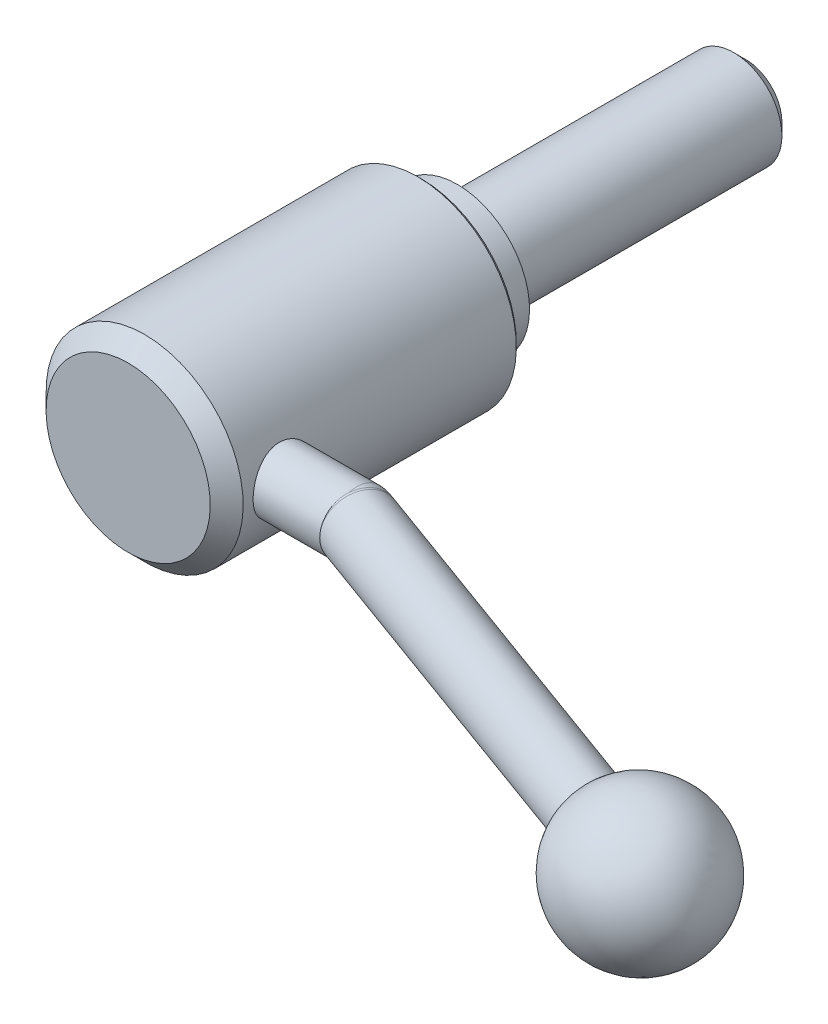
ISO-10303-21;
HEADER;
FILE_DESCRIPTION(('STEP AP214'),'2;1');
FILE_NAME('part.step','',(''),(''),'','','');
FILE_SCHEMA(('AUTOMOTIVE_DESIGN { 1 0 10303 214 1 1 1 1 }'));
ENDSEC;
DATA;
#1=APPLICATION_CONTEXT('core data for automotive mechanical design processes');
#2=APPLICATION_PROTOCOL_DEFINITION('international standard','automotive_design',2000,#1);
#3=PRODUCT_CONTEXT('',#1,'mechanical');
#4=PRODUCT('Part','Part','',(#3));
#5=PRODUCT_RELATED_PRODUCT_CATEGORY('part','',(#4));
#6=PRODUCT_DEFINITION_FORMATION('','',#4);
#7=PRODUCT_DEFINITION_CONTEXT('part definition',#1,'design');
#8=PRODUCT_DEFINITION('design','',#6,#7);
#9=PRODUCT_DEFINITION_SHAPE('','',#8);
#10=(LENGTH_UNIT() NAMED_UNIT(*) SI_UNIT(.MILLI.,.METRE.));
#11=(NAMED_UNIT(*) PLANE_ANGLE_UNIT() SI_UNIT($,.RADIAN.));
#12=(NAMED_UNIT(*) SI_UNIT($,.STERADIAN.) SOLID_ANGLE_UNIT());
#13=UNCERTAINTY_MEASURE_WITH_UNIT(LENGTH_MEASURE(1.E-05),#10,'distance_accuracy_value','');
#14=(GEOMETRIC_REPRESENTATION_CONTEXT(3) GLOBAL_UNCERTAINTY_ASSIGNED_CONTEXT((#13)) GLOBAL_UNIT_ASSIGNED_CONTEXT((#10,
#11,#12)) REPRESENTATION_CONTEXT('',''));
#15=CARTESIAN_POINT('',(0.,0.,0.));
#16=DIRECTION('',(0.,0.,1.));
#17=DIRECTION('',(1.,0.,0.));
#18=AXIS2_PLACEMENT_3D('',#15,#16,#17);
#19=CARTESIAN_POINT('',(0.,0.,0.));
#20=DIRECTION('',(0.,0.,-1.));
#21=DIRECTION('',(0.,1.,0.));
#22=AXIS2_PLACEMENT_3D('',#19,#20,#21);
#23=CYLINDRICAL_SURFACE('',#22,20.5);
#24=CARTESIAN_POINT('',(0.,0.,8.25));
#25=DIRECTION('',(0.,0.,-1.));
#26=DIRECTION('',(0.,1.,0.));
#27=AXIS2_PLACEMENT_3D('',#24,#25,#26);
#28=CIRCLE('',#27,20.5);
#29=CARTESIAN_POINT('',(0.,20.5,8.25));
#30=VERTEX_POINT('',#29);
#31=EDGE_CURVE('E160',#30,#30,#28,.T.);
#32=ORIENTED_EDGE('',*,*,#31,.F.);
#33=EDGE_LOOP('',(#32));
#34=FACE_BOUND('',#33,.T.);
#35=CARTESIAN_POINT('',(19.4422220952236,6.5,56.5));
#36=CARTESIAN_POINT('',(19.4422222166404,6.49999984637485,56.6775608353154));
#37=CARTESIAN_POINT('',(19.4446611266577,6.49271825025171,56.8551242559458));
#38=CARTESIAN_POINT('',(19.454338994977,6.46366201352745,57.2089295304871));
#39=CARTESIAN_POINT('',(19.4615780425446,6.44188710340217,57.3851713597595));
#40=CARTESIAN_POINT('',(19.4806268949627,6.38405046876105,57.7350468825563));
#41=CARTESIAN_POINT('',(19.4924368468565,6.34798828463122,57.9086804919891));
#42=CARTESIAN_POINT('',(19.5202654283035,6.26189122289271,58.2521641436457));
#43=CARTESIAN_POINT('',(19.5362855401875,6.2118514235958,58.4220128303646));
#44=CARTESIAN_POINT('',(19.5720112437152,6.09835258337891,58.7563693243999));
#45=CARTESIAN_POINT('',(19.5917092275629,6.03492120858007,58.9208873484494));
#46=CARTESIAN_POINT('',(19.6342385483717,5.89508386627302,59.2438952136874));
#47=CARTESIAN_POINT('',(19.6570700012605,5.8186774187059,59.4023848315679));
#48=CARTESIAN_POINT('',(19.7052295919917,5.65343532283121,59.7124029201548));
#49=CARTESIAN_POINT('',(19.7305584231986,5.5645962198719,59.8639294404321));
#50=CARTESIAN_POINT('',(19.7830095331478,5.37514542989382,60.159036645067));
#51=CARTESIAN_POINT('',(19.810131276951,5.27453724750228,60.3026196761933));
#52=CARTESIAN_POINT('',(19.8663573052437,5.05872294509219,60.5855845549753));
#53=CARTESIAN_POINT('',(19.8954973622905,4.94314912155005,60.7246789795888));
#54=CARTESIAN_POINT('',(19.9541229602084,4.70090397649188,60.9926738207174));
#55=CARTESIAN_POINT('',(19.9836083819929,4.57423638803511,61.1215776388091));
#56=CARTESIAN_POINT('',(20.0421539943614,4.31048905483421,61.3685042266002));
#57=CARTESIAN_POINT('',(20.071213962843,4.1734040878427,61.4865214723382));
#58=CARTESIAN_POINT('',(20.1281044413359,3.88977145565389,61.7107919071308));
#59=CARTESIAN_POINT('',(20.1559354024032,3.74322731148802,61.8170494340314));
#60=CARTESIAN_POINT('',(20.2102746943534,3.43793523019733,62.0195055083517));
#61=CARTESIAN_POINT('',(20.236735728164,3.2789797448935,62.1154041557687));
#62=CARTESIAN_POINT('',(20.2868421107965,2.95316588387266,62.2933802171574));
#63=CARTESIAN_POINT('',(20.3104885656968,2.786310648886,62.3754630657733));
#64=CARTESIAN_POINT('',(20.3543059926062,2.44575238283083,62.5251888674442));
#65=CARTESIAN_POINT('',(20.3744761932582,2.27204784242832,62.5928286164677));
#66=CARTESIAN_POINT('',(20.4107390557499,1.9191592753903,62.7130148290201));
#67=CARTESIAN_POINT('',(20.4268335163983,1.73997770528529,62.7655679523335));
#68=CARTESIAN_POINT('',(20.4540467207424,1.38310784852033,62.8537177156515));
#69=CARTESIAN_POINT('',(20.4653055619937,1.20554867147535,62.8897940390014));
#70=CARTESIAN_POINT('',(20.483240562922,0.847880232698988,62.9470057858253));
#71=CARTESIAN_POINT('',(20.489918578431,0.667772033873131,62.9681472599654));
#72=CARTESIAN_POINT('',(20.4985086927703,0.306306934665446,62.9953079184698));
#73=CARTESIAN_POINT('',(20.5004208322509,0.124950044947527,63.0013272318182));
#74=CARTESIAN_POINT('',(20.4994243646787,-0.237616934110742,62.9981845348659));
#75=CARTESIAN_POINT('',(20.4965158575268,-0.418827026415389,62.9890228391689));
#76=CARTESIAN_POINT('',(20.4861511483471,-0.773249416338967,62.9562077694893));
#77=CARTESIAN_POINT('',(20.4788613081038,-0.946515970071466,62.9330843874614));
#78=CARTESIAN_POINT('',(20.4600679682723,-1.29046183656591,62.8730051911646));
#79=CARTESIAN_POINT('',(20.4485630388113,-1.46114025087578,62.8360446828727));
#80=CARTESIAN_POINT('',(20.4216452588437,-1.798625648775,62.7486256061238));
#81=CARTESIAN_POINT('',(20.4062336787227,-1.9654338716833,62.6981714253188));
#82=CARTESIAN_POINT('',(20.3718916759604,-2.29420139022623,62.5841535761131));
#83=CARTESIAN_POINT('',(20.35295992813,-2.45615883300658,62.5205849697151));
#84=CARTESIAN_POINT('',(20.3118147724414,-2.77605889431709,62.3799991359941));
#85=CARTESIAN_POINT('',(20.2895645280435,-2.93392950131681,62.3028289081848));
#86=CARTESIAN_POINT('',(20.2425168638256,-3.24266972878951,62.1361230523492));
#87=CARTESIAN_POINT('',(20.2177185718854,-3.39353692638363,62.0465831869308));
#88=CARTESIAN_POINT('',(20.1662066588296,-3.68732340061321,61.8557751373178));
#89=CARTESIAN_POINT('',(20.1394929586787,-3.8302423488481,61.7545064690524));
#90=CARTESIAN_POINT('',(20.0848204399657,-4.10730208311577,61.5408997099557));
#91=CARTESIAN_POINT('',(20.0568615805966,-4.24144258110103,61.4285612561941));
#92=CARTESIAN_POINT('',(19.9991827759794,-4.50574800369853,61.1884400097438));
#93=CARTESIAN_POINT('',(19.9694388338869,-4.63549313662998,61.0602005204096));
#94=CARTESIAN_POINT('',(19.9101839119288,-4.88373422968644,60.7932909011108));
#95=CARTESIAN_POINT('',(19.8806728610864,-5.00223374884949,60.6546240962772));
#96=CARTESIAN_POINT('',(19.8226810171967,-5.22731613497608,60.3676143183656));
#97=CARTESIAN_POINT('',(19.7942007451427,-5.33389303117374,60.2192665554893));
#98=CARTESIAN_POINT('',(19.739110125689,-5.53428674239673,59.9139422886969));
#99=CARTESIAN_POINT('',(19.7124990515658,-5.62810852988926,59.7569691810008));
#100=CARTESIAN_POINT('',(19.6616069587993,-5.80341705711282,59.4333642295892));
#101=CARTESIAN_POINT('',(19.6373585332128,-5.88473833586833,59.2666375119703));
#102=CARTESIAN_POINT('',(19.5923338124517,-6.03294761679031,58.9265081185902));
#103=CARTESIAN_POINT('',(19.5715561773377,-6.09984119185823,58.7531080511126));
#104=CARTESIAN_POINT('',(19.5341361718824,-6.21863379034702,58.4008267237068));
#105=CARTESIAN_POINT('',(19.5174933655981,-6.2705343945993,58.2219460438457));
#106=CARTESIAN_POINT('',(19.4888985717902,-6.35885149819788,57.8600357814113));
#107=CARTESIAN_POINT('',(19.4769463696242,-6.39526870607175,57.6770063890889));
#108=CARTESIAN_POINT('',(19.4585313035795,-6.45107630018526,57.3158506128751));
#109=CARTESIAN_POINT('',(19.4518622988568,-6.47110721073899,57.1378335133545));
#110=CARTESIAN_POINT('',(19.443427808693,-6.49640633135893,56.7806394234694));
#111=CARTESIAN_POINT('',(19.4416621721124,-6.50167499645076,56.6014624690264));
#112=CARTESIAN_POINT('',(19.443091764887,-6.49739848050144,56.2433320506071));
#113=CARTESIAN_POINT('',(19.4462862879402,-6.48785540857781,56.0643785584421));
#114=CARTESIAN_POINT('',(19.4575309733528,-6.45405335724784,55.7080231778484));
#115=CARTESIAN_POINT('',(19.4655810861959,-6.4297945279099,55.5306212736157));
#116=CARTESIAN_POINT('',(19.4859636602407,-6.36775067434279,55.1840196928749));
#117=CARTESIAN_POINT('',(19.4981590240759,-6.33039761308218,55.0147343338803));
#118=CARTESIAN_POINT('',(19.5265148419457,-6.24238368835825,54.6799411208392));
#119=CARTESIAN_POINT('',(19.5426766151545,-6.19171839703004,54.5144345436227));
#120=CARTESIAN_POINT('',(19.5784935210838,-6.07751333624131,54.1883625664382));
#121=CARTESIAN_POINT('',(19.598147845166,-6.01397654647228,54.0277960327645));
#122=CARTESIAN_POINT('',(19.6404122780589,-5.87448001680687,53.7124890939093));
#123=CARTESIAN_POINT('',(19.663023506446,-5.79851556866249,53.5577509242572));
#124=CARTESIAN_POINT('',(19.711276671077,-5.63234141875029,53.2506795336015));
#125=CARTESIAN_POINT('',(19.7369874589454,-5.54178262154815,53.0985460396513));
#126=CARTESIAN_POINT('',(19.7901869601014,-5.34869406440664,52.8023330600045));
#127=CARTESIAN_POINT('',(19.8176762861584,-5.24616016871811,52.6582563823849));
#128=CARTESIAN_POINT('',(19.8736901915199,-5.02980339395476,52.3790447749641));
#129=CARTESIAN_POINT('',(19.9022148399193,-4.91597976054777,52.2439104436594));
#130=CARTESIAN_POINT('',(19.9595511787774,-4.67774787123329,51.9833824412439));
#131=CARTESIAN_POINT('',(19.9883628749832,-4.55333940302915,51.8579889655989));
#132=CARTESIAN_POINT('',(20.0467640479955,-4.28909489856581,51.612508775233));
#133=CARTESIAN_POINT('',(20.0763335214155,-4.14882502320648,51.4928837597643));
#134=CARTESIAN_POINT('',(20.1341446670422,-3.85851185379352,51.2658977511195));
#135=CARTESIAN_POINT('',(20.1623867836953,-3.70847187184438,51.1585326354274));
#136=CARTESIAN_POINT('',(20.2167791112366,-3.39947872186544,50.956751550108));
#137=CARTESIAN_POINT('',(20.2429285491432,-3.24052229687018,50.8623403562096));
#138=CARTESIAN_POINT('',(20.2923799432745,-2.91486277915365,50.6872782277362));
#139=CARTESIAN_POINT('',(20.31568308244,-2.74816294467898,50.606621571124));
#140=CARTESIAN_POINT('',(20.3586447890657,-2.40926409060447,50.4601915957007));
#141=CARTESIAN_POINT('',(20.3783271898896,-2.23711047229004,50.3943202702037));
#142=CARTESIAN_POINT('',(20.4136744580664,-1.88752303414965,50.2773627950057));
#143=CARTESIAN_POINT('',(20.4293409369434,-1.71009136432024,50.2262707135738));
#144=CARTESIAN_POINT('',(20.4562117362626,-1.35121271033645,50.1393152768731));
#145=CARTESIAN_POINT('',(20.4674163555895,-1.16976599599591,50.1034509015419));
#146=CARTESIAN_POINT('',(20.4850348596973,-0.804250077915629,50.0472977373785));
#147=CARTESIAN_POINT('',(20.4914489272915,-0.620180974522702,50.0270083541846));
#148=CARTESIAN_POINT('',(20.4991281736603,-0.258824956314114,50.0027406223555));
#149=CARTESIAN_POINT('',(20.5006028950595,-0.0815867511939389,49.9980984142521));
#150=CARTESIAN_POINT('',(20.4989516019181,0.272717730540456,50.0033067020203));
#151=CARTESIAN_POINT('',(20.4958240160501,0.449783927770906,50.0131621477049));
#152=CARTESIAN_POINT('',(20.4850529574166,0.802303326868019,50.0472753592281));
#153=CARTESIAN_POINT('',(20.477411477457,0.977757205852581,50.0715267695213));
#154=CARTESIAN_POINT('',(20.4578179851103,1.32593306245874,50.1342162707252));
#155=CARTESIAN_POINT('',(20.4458643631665,1.49865399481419,50.1726596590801));
#156=CARTESIAN_POINT('',(20.4181583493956,1.83775920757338,50.2627729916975));
#157=CARTESIAN_POINT('',(20.4024599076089,2.00419775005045,50.314255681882));
#158=CARTESIAN_POINT('',(20.3675799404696,2.33214296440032,50.430290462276));
#159=CARTESIAN_POINT('',(20.3483971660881,2.49364784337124,50.4948472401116));
#160=CARTESIAN_POINT('',(20.3070431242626,2.8106122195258,50.6365039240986));
#161=CARTESIAN_POINT('',(20.2848725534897,2.96607311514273,50.7136009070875));
#162=CARTESIAN_POINT('',(20.2380837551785,3.2701125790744,50.8798225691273));
#163=CARTESIAN_POINT('',(20.2134646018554,3.41868851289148,50.9689518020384));
#164=CARTESIAN_POINT('',(20.1615167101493,3.71299497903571,51.1618658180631));
#165=CARTESIAN_POINT('',(20.1341240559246,3.85845386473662,51.2660479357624));
#166=CARTESIAN_POINT('',(20.0780825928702,4.14019829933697,51.4859491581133));
#167=CARTESIAN_POINT('',(20.0494333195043,4.27648040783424,51.6016725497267));
#168=CARTESIAN_POINT('',(19.991639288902,4.5389891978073,51.8438784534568));
#169=CARTESIAN_POINT('',(19.9624945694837,4.66521664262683,51.9703601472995));
#170=CARTESIAN_POINT('',(19.9044649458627,4.90690637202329,52.2333644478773));
#171=CARTESIAN_POINT('',(19.8755801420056,5.0223646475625,52.3698907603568));
#172=CARTESIAN_POINT('',(19.8178815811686,5.24550327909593,52.6569714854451));
#173=CARTESIAN_POINT('',(19.7891042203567,5.35278119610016,52.8078463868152));
#174=CARTESIAN_POINT('',(19.7335121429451,5.55422553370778,53.118455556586));
#175=CARTESIAN_POINT('',(19.7066974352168,5.64839189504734,53.2781898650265));
#176=CARTESIAN_POINT('',(19.6558508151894,5.82286763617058,53.6054219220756));
#177=CARTESIAN_POINT('',(19.6318180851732,5.90318109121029,53.77291736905));
#178=CARTESIAN_POINT('',(19.5872824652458,6.04931454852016,54.1145638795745));
#179=CARTESIAN_POINT('',(19.5667793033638,6.11513566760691,54.2887144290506));
#180=CARTESIAN_POINT('',(19.5313806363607,6.22722680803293,54.6288485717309));
#181=CARTESIAN_POINT('',(19.5161756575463,6.27460911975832,54.7944341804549));
#182=CARTESIAN_POINT('',(19.4897776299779,6.35613148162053,55.1291406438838));
#183=CARTESIAN_POINT('',(19.4785842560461,6.39027260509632,55.2982612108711));
#184=CARTESIAN_POINT('',(19.4605385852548,6.44501906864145,55.6389039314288));
#185=CARTESIAN_POINT('',(19.4536861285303,6.46562490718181,55.8104259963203));
#186=CARTESIAN_POINT('',(19.4445285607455,6.49311322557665,56.1546314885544));
#187=CARTESIAN_POINT('',(19.4422219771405,6.50000014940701,56.3273145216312));
#188=CARTESIAN_POINT('',(19.4422220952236,6.5,56.5));
#189=B_SPLINE_CURVE_WITH_KNOTS('',3,(#35,#36,#37,#38,#39,#40,#41,#42,#43,#44,#45,#46,#47,#48,
#49,#50,#51,#52,#53,#54,#55,#56,#57,#58,#59,#60,#61,#62,#63,#64,#65,#66,#67,#68,#69,#70,#71,#72,
#73,#74,#75,#76,#77,#78,#79,#80,#81,#82,#83,#84,#85,#86,#87,#88,#89,#90,#91,#92,#93,#94,#95,#96,
#97,#98,#99,#100,#101,#102,#103,#104,#105,#106,#107,#108,#109,#110,#111,#112,#113,#114,#115,
#116,#117,#118,#119,#120,#121,#122,#123,#124,#125,#126,#127,#128,#129,#130,#131,#132,#133,#134,
#135,#136,#137,#138,#139,#140,#141,#142,#143,#144,#145,#146,#147,#148,#149,#150,#151,#152,#153,
#154,#155,#156,#157,#158,#159,#160,#161,#162,#163,#164,#165,#166,#167,#168,#169,#170,#171,#172,
#173,#174,#175,#176,#177,#178,#179,#180,#181,#182,#183,#184,#185,#186,#187,#188),.UNSPECIFIED.,
.T.,.F.,(4,2,2,2,2,2,2,2,2,2,2,2,2,2,2,2,2,2,2,2,2,2,2,2,2,2,2,2,2,2,2,2,2,2,2,2,2,2,2,2,2,2,2,
2,2,2,2,2,2,2,2,2,2,2,2,2,2,2,2,2,2,2,2,2,2,2,2,2,2,2,2,2,2,2,2,2,4),(0.,0.532521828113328,
1.06505355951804,1.5976024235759,2.13033904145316,2.66198564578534,3.19365192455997,
3.72546623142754,4.25712257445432,4.80602728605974,5.35474799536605,5.90374561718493,
6.45254004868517,7.0144069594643,7.5760523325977,8.13782217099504,8.6993436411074,
9.24327177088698,9.78697940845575,10.3306824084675,10.8743741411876,11.3986215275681,
11.9230469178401,12.4473019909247,12.9717548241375,13.5025350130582,14.0334974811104,
14.5644818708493,15.0954836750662,15.6493464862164,16.2030334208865,16.7569964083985,
17.3107428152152,17.8712831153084,18.4316065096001,18.991870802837,19.5521094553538,
20.0892329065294,20.6263398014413,21.163370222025,21.7003951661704,22.2211537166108,
22.7420856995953,23.2628972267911,23.7839065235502,24.3200181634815,24.8563155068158,
25.3926487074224,25.9289926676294,26.488454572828,27.0477277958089,27.6072066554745,
28.1664521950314,28.7218733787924,29.2770713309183,29.8322320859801,30.3873716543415,
30.9186402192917,31.4500902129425,31.9813057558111,32.512719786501,33.0368968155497,
33.5612621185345,34.0855053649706,34.6099475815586,35.1523480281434,35.6949507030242,
36.237512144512,36.7802747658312,37.3416479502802,37.9030236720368,38.4642339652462,
39.0254009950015,39.5435300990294,40.061617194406,40.579685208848,41.0975853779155),.UNSPECIFIED.);
#190=CARTESIAN_POINT('',(19.4422220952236,6.5,56.5));
#191=VERTEX_POINT('',#190);
#192=EDGE_CURVE('E79',#191,#191,#189,.T.);
#193=ORIENTED_EDGE('',*,*,#192,.F.);
#194=EDGE_LOOP('',(#193));
#195=FACE_BOUND('',#194,.T.);
#196=CARTESIAN_POINT('',(0.,0.,65.075));
#197=DIRECTION('',(0.,0.,-1.));
#198=DIRECTION('',(0.,1.,0.));
#199=AXIS2_PLACEMENT_3D('',#196,#197,#198);
#200=CIRCLE('',#199,20.5);
#201=CARTESIAN_POINT('',(0.,20.5,65.075));
#202=VERTEX_POINT('',#201);
#203=EDGE_CURVE('E163',#202,#202,#200,.T.);
#204=ORIENTED_EDGE('',*,*,#203,.T.);
#205=EDGE_LOOP('',(#204));
#206=FACE_BOUND('',#205,.T.);
#207=ADVANCED_FACE('F15',(#34,#195,#206),#23,.T.);
#208=CARTESIAN_POINT('',(0.,0.,68.5));
#209=DIRECTION('',(0.,0.,-1.));
#210=DIRECTION('',(0.,1.,0.));
#211=AXIS2_PLACEMENT_3D('',#208,#209,#210);
#212=PLANE('',#211);
#213=CARTESIAN_POINT('',(0.,0.,68.5));
#214=DIRECTION('',(0.,0.,-1.));
#215=DIRECTION('',(0.,1.,0.));
#216=AXIS2_PLACEMENT_3D('',#213,#214,#215);
#217=CIRCLE('',#216,17.075);
#218=CARTESIAN_POINT('',(0.,17.075,68.5));
#219=VERTEX_POINT('',#218);
#220=EDGE_CURVE('E88',#219,#219,#217,.T.);
#221=ORIENTED_EDGE('',*,*,#220,.F.);
#222=EDGE_LOOP('',(#221));
#223=FACE_BOUND('',#222,.T.);
#224=ADVANCED_FACE('F63',(#223),#212,.F.);
#225=CARTESIAN_POINT('',(0.,0.,68.5));
#226=DIRECTION('',(0.,0.,-1.));
#227=DIRECTION('',(0.,1.,0.));
#228=AXIS2_PLACEMENT_3D('',#225,#226,#227);
#229=CONICAL_SURFACE('',#228,17.075,0.785398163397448);
#230=ORIENTED_EDGE('',*,*,#203,.F.);
#231=EDGE_LOOP('',(#230));
#232=FACE_BOUND('',#231,.T.);
#233=ORIENTED_EDGE('',*,*,#220,.T.);
#234=EDGE_LOOP('',(#233));
#235=FACE_BOUND('',#234,.T.);
#236=ADVANCED_FACE('F69',(#232,#235),#229,.T.);
#237=CARTESIAN_POINT('',(0.,0.,8.25));
#238=DIRECTION('',(0.,0.,1.));
#239=DIRECTION('',(0.,-1.,0.));
#240=AXIS2_PLACEMENT_3D('',#237,#238,#239);
#241=CONICAL_SURFACE('',#240,20.5,0.785398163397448);
#242=CARTESIAN_POINT('',(0.,0.,7.5));
#243=DIRECTION('',(0.,0.,-1.));
#244=DIRECTION('',(0.,1.,0.));
#245=AXIS2_PLACEMENT_3D('',#242,#243,#244);
#246=CIRCLE('',#245,19.75);
#247=CARTESIAN_POINT('',(0.,19.75,7.5));
#248=VERTEX_POINT('',#247);
#249=EDGE_CURVE('E154',#248,#248,#246,.T.);
#250=ORIENTED_EDGE('',*,*,#249,.F.);
#251=EDGE_LOOP('',(#250));
#252=FACE_BOUND('',#251,.T.);
#253=ORIENTED_EDGE('',*,*,#31,.T.);
#254=EDGE_LOOP('',(#253));
#255=FACE_BOUND('',#254,.T.);
#256=ADVANCED_FACE('F76',(#252,#255),#241,.T.);
#257=CARTESIAN_POINT('',(19.75,0.,7.5));
#258=DIRECTION('',(0.,0.,1.));
#259=DIRECTION('',(0.,-1.,0.));
#260=AXIS2_PLACEMENT_3D('',#257,#258,#259);
#261=PLANE('',#260);
#262=CARTESIAN_POINT('',(0.,0.,7.5));
#263=DIRECTION('',(0.,0.,-1.));
#264=DIRECTION('',(0.,1.,0.));
#265=AXIS2_PLACEMENT_3D('',#262,#263,#264);
#266=CIRCLE('',#265,15.);
#267=CARTESIAN_POINT('',(0.,15.,7.5));
#268=VERTEX_POINT('',#267);
#269=EDGE_CURVE('E150',#268,#268,#266,.T.);
#270=ORIENTED_EDGE('',*,*,#269,.F.);
#271=EDGE_LOOP('',(#270));
#272=FACE_BOUND('',#271,.T.);
#273=ORIENTED_EDGE('',*,*,#249,.T.);
#274=EDGE_LOOP('',(#273));
#275=FACE_BOUND('',#274,.T.);
#276=ADVANCED_FACE('F177',(#272,#275),#261,.F.);
#277=CARTESIAN_POINT('',(0.,0.,0.));
#278=DIRECTION('',(0.,0.,-1.));
#279=DIRECTION('',(0.,1.,0.));
#280=AXIS2_PLACEMENT_3D('',#277,#278,#279);
#281=CYLINDRICAL_SURFACE('',#280,15.);
#282=CARTESIAN_POINT('',(0.,0.,0.));
#283=DIRECTION('',(0.,0.,-1.));
#284=DIRECTION('',(0.,1.,0.));
#285=AXIS2_PLACEMENT_3D('',#282,#283,#284);
#286=CIRCLE('',#285,15.);
#287=CARTESIAN_POINT('',(0.,15.,0.));
#288=VERTEX_POINT('',#287);
#289=EDGE_CURVE('E147',#288,#288,#286,.T.);
#290=ORIENTED_EDGE('',*,*,#289,.F.);
#291=EDGE_LOOP('',(#290));
#292=FACE_BOUND('',#291,.T.);
#293=ORIENTED_EDGE('',*,*,#269,.T.);
#294=EDGE_LOOP('',(#293));
#295=FACE_BOUND('',#294,.T.);
#296=ADVANCED_FACE('F144',(#292,#295),#281,.T.);
#297=CARTESIAN_POINT('',(15.,0.,0.));
#298=DIRECTION('',(0.,0.,1.));
#299=DIRECTION('',(0.,-1.,0.));
#300=AXIS2_PLACEMENT_3D('',#297,#298,#299);
#301=PLANE('',#300);
#302=CARTESIAN_POINT('',(0.,0.,0.));
#303=DIRECTION('',(0.,0.,-1.));
#304=DIRECTION('',(0.,1.,0.));
#305=AXIS2_PLACEMENT_3D('',#302,#303,#304);
#306=CIRCLE('',#305,10.);
#307=CARTESIAN_POINT('',(0.,10.,0.));
#308=VERTEX_POINT('',#307);
#309=EDGE_CURVE('E134',#308,#308,#306,.T.);
#310=ORIENTED_EDGE('',*,*,#309,.F.);
#311=EDGE_LOOP('',(#310));
#312=FACE_BOUND('',#311,.T.);
#313=ORIENTED_EDGE('',*,*,#289,.T.);
#314=EDGE_LOOP('',(#313));
#315=FACE_BOUND('',#314,.T.);
#316=ADVANCED_FACE('F96',(#312,#315),#301,.F.);
#317=CARTESIAN_POINT('',(42.,0.,56.5));
#318=DIRECTION('',(1.,0.,0.));
#319=DIRECTION('',(0.,1.,0.));
#320=AXIS2_PLACEMENT_3D('',#317,#318,#319);
#321=CYLINDRICAL_SURFACE('',#320,6.5);
#322=CARTESIAN_POINT('',(35.5002,-6.28048269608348,58.1749737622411));
#323=CARTESIAN_POINT('',(35.4701911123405,-6.2584855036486,58.2574684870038));
#324=CARTESIAN_POINT('',(35.4414052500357,-6.23475002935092,58.3399237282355));
#325=CARTESIAN_POINT('',(35.3859523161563,-6.18381246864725,58.5044625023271));
#326=CARTESIAN_POINT('',(35.3592849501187,-6.15661086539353,58.5865460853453));
#327=CARTESIAN_POINT('',(35.2819864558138,-6.06984393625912,58.8317442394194));
#328=CARTESIAN_POINT('',(35.2340264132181,-6.00509209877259,58.9938982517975));
#329=CARTESIAN_POINT('',(35.1437652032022,-5.8621289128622,59.3135555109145));
#330=CARTESIAN_POINT('',(35.1014588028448,-5.78393016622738,59.471062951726));
#331=CARTESIAN_POINT('',(35.0215196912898,-5.61443273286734,59.7801227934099));
#332=CARTESIAN_POINT('',(34.9838873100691,-5.5231331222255,59.9316747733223));
#333=CARTESIAN_POINT('',(34.9127228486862,-5.32805112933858,60.2273614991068));
#334=CARTESIAN_POINT('',(34.8791877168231,-5.22427815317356,60.371501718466));
#335=CARTESIAN_POINT('',(34.8157745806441,-5.00483968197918,60.6512875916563));
#336=CARTESIAN_POINT('',(34.7858966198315,-4.88917404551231,60.7869331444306));
#337=CARTESIAN_POINT('',(34.7295154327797,-4.64671898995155,61.048605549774));
#338=CARTESIAN_POINT('',(34.7030116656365,-4.51993135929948,61.1746339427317));
#339=CARTESIAN_POINT('',(34.6531671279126,-4.25605741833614,61.4160918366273));
#340=CARTESIAN_POINT('',(34.6298263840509,-4.11897102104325,61.5315212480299));
#341=CARTESIAN_POINT('',(34.5859306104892,-3.83395076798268,61.7520111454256));
#342=CARTESIAN_POINT('',(34.5654071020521,-3.68591886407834,61.8569512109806));
#343=CARTESIAN_POINT('',(34.5273160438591,-3.38127311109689,62.0542722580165));
#344=CARTESIAN_POINT('',(34.5097495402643,-3.22465625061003,62.1466487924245));
#345=CARTESIAN_POINT('',(34.4775004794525,-2.90402878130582,62.3180456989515));
#346=CARTESIAN_POINT('',(34.4628174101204,-2.74001949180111,62.3970684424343));
#347=CARTESIAN_POINT('',(34.4362651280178,-2.4056942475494,62.5411738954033));
#348=CARTESIAN_POINT('',(34.424396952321,-2.23537599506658,62.606251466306));
#349=CARTESIAN_POINT('',(34.4035252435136,-1.89117431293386,62.7214241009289));
#350=CARTESIAN_POINT('',(34.3944984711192,-1.71733288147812,62.7716404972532));
#351=CARTESIAN_POINT('',(34.3791416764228,-1.36588965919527,62.8574425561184));
#352=CARTESIAN_POINT('',(34.3728126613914,-1.18828648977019,62.8930227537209));
#353=CARTESIAN_POINT('',(34.3628391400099,-0.830755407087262,62.9492305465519));
#354=CARTESIAN_POINT('',(34.3591931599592,-0.650828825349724,62.9698663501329));
#355=CARTESIAN_POINT('',(34.3545680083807,-0.289765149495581,62.996061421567));
#356=CARTESIAN_POINT('',(34.3535900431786,-0.108627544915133,63.0016138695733));
#357=CARTESIAN_POINT('',(34.3542996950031,0.252555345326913,62.9975893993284));
#358=CARTESIAN_POINT('',(34.355973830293,0.43260151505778,62.9880890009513));
#359=CARTESIAN_POINT('',(34.361966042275,0.791157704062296,62.9541833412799));
#360=CARTESIAN_POINT('',(34.3662829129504,0.969668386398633,62.9297848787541));
#361=CARTESIAN_POINT('',(34.377575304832,1.32405576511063,62.8662625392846));
#362=CARTESIAN_POINT('',(34.3845521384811,1.49993111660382,62.8271313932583));
#363=CARTESIAN_POINT('',(34.4011832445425,1.847645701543,62.7344660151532));
#364=CARTESIAN_POINT('',(34.4108365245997,2.01948640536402,62.6809371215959));
#365=CARTESIAN_POINT('',(34.4328583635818,2.35804742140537,62.5598634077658));
#366=CARTESIAN_POINT('',(34.4452278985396,2.52476586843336,62.4923135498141));
#367=CARTESIAN_POINT('',(34.472721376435,2.85178734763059,62.3437616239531));
#368=CARTESIAN_POINT('',(34.4878443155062,3.01209269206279,62.2627644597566));
#369=CARTESIAN_POINT('',(34.5209144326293,3.32526997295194,62.0879110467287));
#370=CARTESIAN_POINT('',(34.538862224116,3.47814028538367,61.9940520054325));
#371=CARTESIAN_POINT('',(34.5776589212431,3.77530504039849,61.7942532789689));
#372=CARTESIAN_POINT('',(34.5985068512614,3.9196023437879,61.6883176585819));
#373=CARTESIAN_POINT('',(34.6433408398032,4.199419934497,61.4645872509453));
#374=CARTESIAN_POINT('',(34.6673426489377,4.33489069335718,61.3467336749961));
#375=CARTESIAN_POINT('',(34.7185603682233,4.59531298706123,61.1005655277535));
#376=CARTESIAN_POINT('',(34.7457763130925,4.72026440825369,60.9722508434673));
#377=CARTESIAN_POINT('',(34.8036465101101,4.95882988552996,60.70617837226));
#378=CARTESIAN_POINT('',(34.8343011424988,5.07244268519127,60.5684195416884));
#379=CARTESIAN_POINT('',(34.8993555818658,5.28757920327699,60.2846019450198));
#380=CARTESIAN_POINT('',(34.9337552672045,5.38910331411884,60.1385434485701));
#381=CARTESIAN_POINT('',(35.0048466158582,5.57448375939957,59.8471450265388));
#382=CARTESIAN_POINT('',(35.0413260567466,5.65898432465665,59.7021627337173));
#383=CARTESIAN_POINT('',(35.1186048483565,5.81610839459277,59.4070309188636));
#384=CARTESIAN_POINT('',(35.1594036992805,5.88873327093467,59.2568819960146));
#385=CARTESIAN_POINT('',(35.2461889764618,6.02181290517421,58.9526179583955));
#386=CARTESIAN_POINT('',(35.2921778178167,6.08226196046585,58.798501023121));
#387=CARTESIAN_POINT('',(35.3660624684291,6.16360062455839,58.5656236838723));
#388=CARTESIAN_POINT('',(35.3915152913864,6.18916346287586,58.4876924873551));
#389=CARTESIAN_POINT('',(35.4443438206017,6.23716716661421,58.3315099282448));
#390=CARTESIAN_POINT('',(35.4717197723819,6.25960763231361,58.2532585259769));
#391=CARTESIAN_POINT('',(35.5001999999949,6.28048269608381,58.17497376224));
#392=B_SPLINE_CURVE_WITH_KNOTS('',3,(#322,#323,#324,#325,#326,#327,#328,#329,#330,#331,#332,
#333,#334,#335,#336,#337,#338,#339,#340,#341,#342,#343,#344,#345,#346,#347,#348,#349,#350,#351,
#352,#353,#354,#355,#356,#357,#358,#359,#360,#361,#362,#363,#364,#365,#366,#367,#368,#369,#370,
#371,#372,#373,#374,#375,#376,#377,#378,#379,#380,#381,#382,#383,#384,#385,#386,#387,#388,#389,
#390,#391),.UNSPECIFIED.,.F.,.F.,(4,2,2,2,2,2,2,2,2,2,2,2,2,2,2,2,2,2,2,2,2,2,2,2,2,2,2,2,2,2,2,
2,2,2,4),(0.,0.271433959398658,0.542830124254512,1.08532167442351,1.62730757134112,
2.16933170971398,2.71094964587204,3.25257402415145,3.79411146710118,4.33565348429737,
4.88283172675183,5.43020315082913,5.97747727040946,6.52495270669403,7.06782653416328,
7.61090287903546,8.15368070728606,8.6967039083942,9.2369755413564,9.77700080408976,
10.3172928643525,10.8573848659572,11.3976712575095,11.9377610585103,12.4779683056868,
13.0179942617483,13.5608276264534,14.1036668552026,14.6465661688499,15.189447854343,
15.7040975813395,16.2186878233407,16.7335185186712,16.99107618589,17.2486667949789),.UNSPECIFIED.);
#393=CARTESIAN_POINT('',(35.5,-6.28033613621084,58.1755232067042));
#394=VERTEX_POINT('',#393);
#395=CARTESIAN_POINT('',(34.3538746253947,0.,63.));
#396=VERTEX_POINT('',#395);
#397=EDGE_CURVE('E31',#394,#396,#392,.T.);
#398=ORIENTED_EDGE('',*,*,#397,.T.);
#399=CARTESIAN_POINT('',(35.5,6.28033613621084,58.1755232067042));
#400=VERTEX_POINT('',#399);
#401=EDGE_CURVE('E101',#396,#400,#392,.T.);
#402=ORIENTED_EDGE('',*,*,#401,.T.);
#403=CARTESIAN_POINT('',(35.5,0.,56.5));
#404=DIRECTION('',(1.,0.,0.));
#405=DIRECTION('',(0.,1.,0.));
#406=AXIS2_PLACEMENT_3D('',#403,#404,#405);
#407=CIRCLE('',#406,6.5);
#408=EDGE_CURVE('E111',#394,#400,#407,.T.);
#409=ORIENTED_EDGE('',*,*,#408,.F.);
#410=EDGE_LOOP('',(#398,#402,#409));
#411=FACE_BOUND('',#410,.T.);
#412=ORIENTED_EDGE('',*,*,#192,.T.);
#413=EDGE_LOOP('',(#412));
#414=FACE_BOUND('',#413,.T.);
#415=ADVANCED_FACE('F90',(#411,#414),#321,.T.);
#416=CARTESIAN_POINT('',(35.5,0.,56.5));
#417=DIRECTION('',(1.,0.,0.));
#418=DIRECTION('',(0.,0.,-1.));
#419=AXIS2_PLACEMENT_3D('',#416,#417,#418);
#420=SPHERICAL_SURFACE('',#419,6.5);
#421=CARTESIAN_POINT('',(36.0385027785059,0.,56.6959989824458));
#422=DIRECTION('',(0.93969262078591,0.,0.342020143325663));
#423=DIRECTION('',(-0.342020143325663,0.,0.939692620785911));
#424=AXIS2_PLACEMENT_3D('',#421,#422,#423);
#425=CIRCLE('',#424,6.4746891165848);
#426=EDGE_CURVE('E38',#394,#400,#425,.T.);
#427=ORIENTED_EDGE('',*,*,#426,.F.);
#428=ORIENTED_EDGE('',*,*,#408,.T.);
#429=EDGE_LOOP('',(#427,#428));
#430=FACE_BOUND('',#429,.T.);
#431=ADVANCED_FACE('F95',(#430),#420,.T.);
#432=CARTESIAN_POINT('',(36.5770055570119,0.,56.8919979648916));
#433=DIRECTION('',(0.939692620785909,0.,0.342020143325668));
#434=DIRECTION('',(-0.342020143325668,0.,0.939692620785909));
#435=AXIS2_PLACEMENT_3D('',#432,#433,#434);
#436=SPHERICAL_SURFACE('',#435,6.5);
#437=ORIENTED_EDGE('',*,*,#397,.F.);
#438=ORIENTED_EDGE('',*,*,#426,.T.);
#439=ORIENTED_EDGE('',*,*,#401,.F.);
#440=CARTESIAN_POINT('',(36.5770055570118,0.,56.8919979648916));
#441=DIRECTION('',(0.939692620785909,0.,0.342020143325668));
#442=DIRECTION('',(-0.342020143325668,0.,0.939692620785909));
#443=AXIS2_PLACEMENT_3D('',#440,#441,#442);
#444=CIRCLE('',#443,6.5);
#445=EDGE_CURVE('E109',#396,#396,#444,.T.);
#446=ORIENTED_EDGE('',*,*,#445,.F.);
#447=EDGE_LOOP('',(#437,#438,#439,#446));
#448=FACE_BOUND('',#447,.T.);
#449=ADVANCED_FACE('F113',(#448),#436,.T.);
#450=CARTESIAN_POINT('',(143.243431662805,0.,95.7154020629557));
#451=DIRECTION('',(0.939692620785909,0.,0.342020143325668));
#452=DIRECTION('',(-0.342020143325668,0.,0.939692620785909));
#453=AXIS2_PLACEMENT_3D('',#450,#451,#452);
#454=CYLINDRICAL_SURFACE('',#453,6.5);
#455=CARTESIAN_POINT('',(116.198996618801,0.,85.8720327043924));
#456=DIRECTION('',(0.939692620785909,0.,0.342020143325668));
#457=DIRECTION('',(-0.342020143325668,0.,0.939692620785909));
#458=AXIS2_PLACEMENT_3D('',#455,#456,#457);
#459=CIRCLE('',#458,6.5);
#460=CARTESIAN_POINT('',(113.975865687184,0.,91.9800347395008));
#461=VERTEX_POINT('',#460);
#462=EDGE_CURVE('E125',#461,#461,#459,.T.);
#463=ORIENTED_EDGE('',*,*,#462,.F.);
#464=EDGE_LOOP('',(#463));
#465=FACE_BOUND('',#464,.T.);
#466=ORIENTED_EDGE('',*,*,#445,.T.);
#467=EDGE_LOOP('',(#466));
#468=FACE_BOUND('',#467,.T.);
#469=ADVANCED_FACE('F58',(#465,#468),#454,.T.);
#470=CARTESIAN_POINT('',(113.975865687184,0.,91.9800347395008));
#471=DIRECTION('',(0.939692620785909,0.,0.342020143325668));
#472=DIRECTION('',(-0.342020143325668,0.,0.939692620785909));
#473=AXIS2_PLACEMENT_3D('',#470,#471,#472);
#474=PLANE('',#473);
#475=CARTESIAN_POINT('',(116.198996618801,0.,85.8720327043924));
#476=DIRECTION('',(0.939692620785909,0.,0.342020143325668));
#477=DIRECTION('',(-0.342020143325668,0.,0.939692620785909));
#478=AXIS2_PLACEMENT_3D('',#475,#476,#477);
#479=CIRCLE('',#478,8.80198315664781);
#480=CARTESIAN_POINT('',(113.188541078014,0.,94.1431913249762));
#481=VERTEX_POINT('',#480);
#482=EDGE_CURVE('E131',#481,#481,#479,.T.);
#483=ORIENTED_EDGE('',*,*,#482,.F.);
#484=EDGE_LOOP('',(#483));
#485=FACE_BOUND('',#484,.T.);
#486=ORIENTED_EDGE('',*,*,#462,.T.);
#487=EDGE_LOOP('',(#486));
#488=FACE_BOUND('',#487,.T.);
#489=ADVANCED_FACE('F47',(#485,#488),#474,.F.);
#490=CARTESIAN_POINT('',(128.5,0.,89.5));
#491=DIRECTION('',(0.,1.,0.));
#492=DIRECTION('',(-0.342020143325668,0.,0.939692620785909));
#493=AXIS2_PLACEMENT_3D('',#490,#491,#492);
#494=CIRCLE('',#493,16.);
#495=TRIMMED_CURVE('',#494,(PARAMETER_VALUE(-1.52089957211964)),
(PARAMETER_VALUE(1.52089957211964)),.T.,.PARAMETER.);
#496=CARTESIAN_POINT('',(128.22706216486,0.,90.2498905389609));
#497=DIRECTION('',(0.939692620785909,0.,0.342020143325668));
#498=AXIS1_PLACEMENT('',#496,#497);
#499=SURFACE_OF_REVOLUTION('',#495,#498);
#500=ORIENTED_EDGE('',*,*,#482,.T.);
#501=EDGE_LOOP('',(#500));
#502=FACE_BOUND('',#501,.T.);
#503=CARTESIAN_POINT('',(143.243431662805,0.,95.7154020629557));
#504=VERTEX_POINT('',#503);
#505=VERTEX_LOOP('',#504);
#506=FACE_BOUND('',#505,.T.);
#507=ADVANCED_FACE('F44',(#502,#506),#499,.T.);
#508=CARTESIAN_POINT('',(0.,0.,27.));
#509=DIRECTION('',(0.,0.,-1.));
#510=DIRECTION('',(-1.,0.,0.));
#511=AXIS2_PLACEMENT_3D('',#508,#509,#510);
#512=CYLINDRICAL_SURFACE('',#511,10.);
#513=CARTESIAN_POINT('',(0.,0.,-57.5));
#514=DIRECTION('',(0.,0.,-1.));
#515=DIRECTION('',(-1.,0.,0.));
#516=AXIS2_PLACEMENT_3D('',#513,#514,#515);
#517=CIRCLE('',#516,10.);
#518=CARTESIAN_POINT('',(-10.,0.,-57.5));
#519=VERTEX_POINT('',#518);
#520=EDGE_CURVE('E9',#519,#519,#517,.F.);
#521=ORIENTED_EDGE('',*,*,#520,.T.);
#522=EDGE_LOOP('',(#521));
#523=FACE_BOUND('',#522,.T.);
#524=ORIENTED_EDGE('',*,*,#309,.T.);
#525=EDGE_LOOP('',(#524));
#526=FACE_BOUND('',#525,.T.);
#527=ADVANCED_FACE('F46',(#523,#526),#512,.T.);
#528=CARTESIAN_POINT('',(0.,0.,-60.));
#529=DIRECTION('',(0.,0.,-1.));
#530=DIRECTION('',(-1.,0.,0.));
#531=AXIS2_PLACEMENT_3D('',#528,#529,#530);
#532=PLANE('',#531);
#533=CARTESIAN_POINT('',(0.,0.,-60.));
#534=DIRECTION('',(0.,0.,-1.));
#535=DIRECTION('',(-1.,0.,0.));
#536=AXIS2_PLACEMENT_3D('',#533,#534,#535);
#537=CIRCLE('',#536,7.5);
#538=CARTESIAN_POINT('',(-7.5,0.,-60.));
#539=VERTEX_POINT('',#538);
#540=EDGE_CURVE('E24',#539,#539,#537,.T.);
#541=ORIENTED_EDGE('',*,*,#540,.T.);
#542=EDGE_LOOP('',(#541));
#543=FACE_BOUND('',#542,.T.);
#544=ADVANCED_FACE('F55',(#543),#532,.T.);
#545=CARTESIAN_POINT('',(0.,0.,-60.));
#546=DIRECTION('',(0.,0.,1.));
#547=DIRECTION('',(1.,0.,0.));
#548=AXIS2_PLACEMENT_3D('',#545,#546,#547);
#549=CONICAL_SURFACE('',#548,7.5,0.785398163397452);
#550=ORIENTED_EDGE('',*,*,#520,.F.);
#551=EDGE_LOOP('',(#550));
#552=FACE_BOUND('',#551,.T.);
#553=ORIENTED_EDGE('',*,*,#540,.F.);
#554=EDGE_LOOP('',(#553));
#555=FACE_BOUND('',#554,.T.);
#556=ADVANCED_FACE('F17',(#552,#555),#549,.T.);
#557=CLOSED_SHELL('',(#207,#224,#236,#256,#276,#296,#316,#415,#431,#449,#469,#489,#507,#527,
#544,#556));
#558=MANIFOLD_SOLID_BREP('B1',#557);
#559=ADVANCED_BREP_SHAPE_REPRESENTATION('',(#18,#558),#14);
#560=SHAPE_DEFINITION_REPRESENTATION(#9,#559);
ENDSEC;
END-ISO-10303-21;
